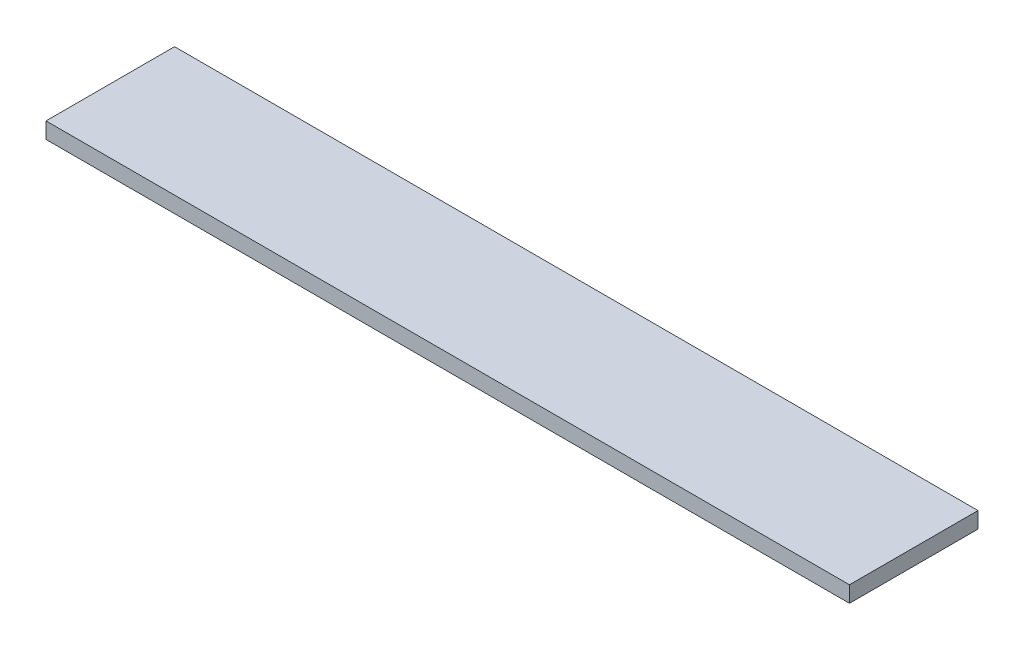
from build123d import *

# Parameters (mm, degrees)
CROQUIS1_W              = 500
CROQUIS1_H              = 10
SALIENTE_EXTRUIR1_DEPTH = 80


with BuildPart() as part:
    # Croquis1 → Saliente-Extruir1 (new body)
    with BuildSketch(Plane.XY):
        with Locations((-250, 168.639844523)):
            Rectangle(CROQUIS1_W, CROQUIS1_H)
    extrude(amount=SALIENTE_EXTRUIR1_DEPTH)


solid = part.part
